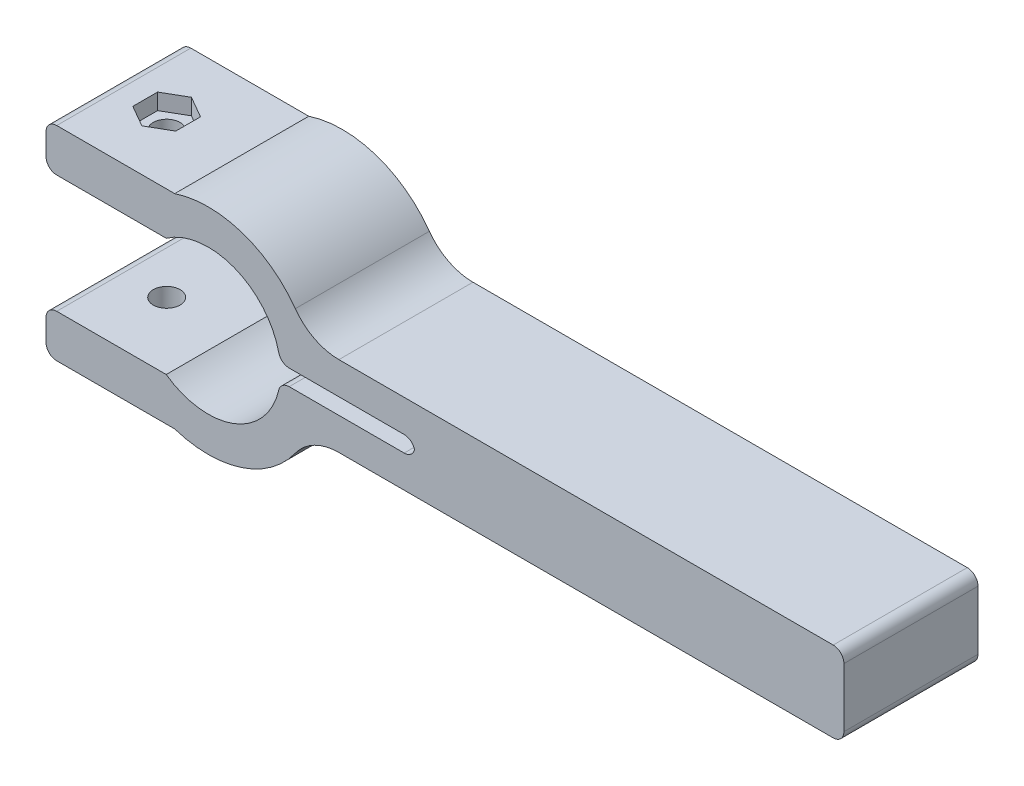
ISO-10303-21;
HEADER;
FILE_DESCRIPTION(('STEP AP214'),'2;1');
FILE_NAME('part.step','',(''),(''),'','','');
FILE_SCHEMA(('AUTOMOTIVE_DESIGN { 1 0 10303 214 1 1 1 1 }'));
ENDSEC;
DATA;
#1=APPLICATION_CONTEXT('core data for automotive mechanical design processes');
#2=APPLICATION_PROTOCOL_DEFINITION('international standard','automotive_design',2000,#1);
#3=PRODUCT_CONTEXT('',#1,'mechanical');
#4=PRODUCT('Part','Part','',(#3));
#5=PRODUCT_RELATED_PRODUCT_CATEGORY('part','',(#4));
#6=PRODUCT_DEFINITION_FORMATION('','',#4);
#7=PRODUCT_DEFINITION_CONTEXT('part definition',#1,'design');
#8=PRODUCT_DEFINITION('design','',#6,#7);
#9=PRODUCT_DEFINITION_SHAPE('','',#8);
#10=(LENGTH_UNIT() NAMED_UNIT(*) SI_UNIT(.MILLI.,.METRE.));
#11=(NAMED_UNIT(*) PLANE_ANGLE_UNIT() SI_UNIT($,.RADIAN.));
#12=(NAMED_UNIT(*) SI_UNIT($,.STERADIAN.) SOLID_ANGLE_UNIT());
#13=UNCERTAINTY_MEASURE_WITH_UNIT(LENGTH_MEASURE(1.E-05),#10,'distance_accuracy_value','');
#14=(GEOMETRIC_REPRESENTATION_CONTEXT(3) GLOBAL_UNCERTAINTY_ASSIGNED_CONTEXT((#13)) GLOBAL_UNIT_ASSIGNED_CONTEXT((#10,
#11,#12)) REPRESENTATION_CONTEXT('',''));
#15=CARTESIAN_POINT('',(0.,0.,0.));
#16=DIRECTION('',(0.,0.,1.));
#17=DIRECTION('',(1.,0.,0.));
#18=AXIS2_PLACEMENT_3D('',#15,#16,#17);
#19=CARTESIAN_POINT('',(0.,0.,25.));
#20=DIRECTION('',(-1.,0.,0.));
#21=DIRECTION('',(0.,-1.,0.));
#22=AXIS2_PLACEMENT_3D('',#19,#20,#21);
#23=PLANE('',#22);
#24=DIRECTION('',(0.,1.,0.));
#25=VECTOR('',#24,1.);
#26=CARTESIAN_POINT('',(0.,0.,0.));
#27=LINE('',#26,#25);
#28=CARTESIAN_POINT('',(0.,2.,0.));
#29=VERTEX_POINT('',#28);
#30=CARTESIAN_POINT('',(0.,13.,0.));
#31=VERTEX_POINT('',#30);
#32=EDGE_CURVE('E305',#29,#31,#27,.T.);
#33=ORIENTED_EDGE('',*,*,#32,.T.);
#34=DIRECTION('',(0.,0.,-1.));
#35=VECTOR('',#34,1.);
#36=CARTESIAN_POINT('',(0.,13.,25.));
#37=LINE('',#36,#35);
#38=CARTESIAN_POINT('',(0.,13.,25.));
#39=VERTEX_POINT('',#38);
#40=EDGE_CURVE('E501',#31,#39,#37,.F.);
#41=ORIENTED_EDGE('',*,*,#40,.T.);
#42=DIRECTION('',(0.,1.,0.));
#43=VECTOR('',#42,1.);
#44=CARTESIAN_POINT('',(0.,0.,25.));
#45=LINE('',#44,#43);
#46=CARTESIAN_POINT('',(0.,2.,25.));
#47=VERTEX_POINT('',#46);
#48=EDGE_CURVE('E313',#47,#39,#45,.T.);
#49=ORIENTED_EDGE('',*,*,#48,.F.);
#50=DIRECTION('',(0.,0.,-1.));
#51=VECTOR('',#50,1.);
#52=CARTESIAN_POINT('',(0.,2.,25.));
#53=LINE('',#52,#51);
#54=EDGE_CURVE('E498',#47,#29,#53,.T.);
#55=ORIENTED_EDGE('',*,*,#54,.T.);
#56=EDGE_LOOP('',(#33,#41,#49,#55));
#57=FACE_BOUND('',#56,.T.);
#58=ADVANCED_FACE('F35',(#57),#23,.F.);
#59=CARTESIAN_POINT('',(0.,15.,25.));
#60=DIRECTION('',(0.,-1.,0.));
#61=DIRECTION('',(1.,0.,0.));
#62=AXIS2_PLACEMENT_3D('',#59,#60,#61);
#63=PLANE('',#62);
#64=DIRECTION('',(-1.,0.,0.));
#65=VECTOR('',#64,1.);
#66=CARTESIAN_POINT('',(0.,15.,25.));
#67=LINE('',#66,#65);
#68=CARTESIAN_POINT('',(-2.,15.,25.));
#69=VERTEX_POINT('',#68);
#70=CARTESIAN_POINT('',(-94.1735103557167,15.,25.));
#71=VERTEX_POINT('',#70);
#72=EDGE_CURVE('E316',#69,#71,#67,.T.);
#73=ORIENTED_EDGE('',*,*,#72,.F.);
#74=DIRECTION('',(0.,0.,-1.));
#75=VECTOR('',#74,1.);
#76=CARTESIAN_POINT('',(-2.,15.,25.));
#77=LINE('',#76,#75);
#78=CARTESIAN_POINT('',(-2.,15.,0.));
#79=VERTEX_POINT('',#78);
#80=EDGE_CURVE('E495',#69,#79,#77,.T.);
#81=ORIENTED_EDGE('',*,*,#80,.T.);
#82=DIRECTION('',(-1.,0.,0.));
#83=VECTOR('',#82,1.);
#84=CARTESIAN_POINT('',(0.,15.,0.));
#85=LINE('',#84,#83);
#86=CARTESIAN_POINT('',(-94.1735103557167,15.,0.));
#87=VERTEX_POINT('',#86);
#88=EDGE_CURVE('E356',#79,#87,#85,.T.);
#89=ORIENTED_EDGE('',*,*,#88,.T.);
#90=DIRECTION('',(0.,0.,1.));
#91=VECTOR('',#90,1.);
#92=CARTESIAN_POINT('',(-94.1735103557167,15.,25.));
#93=LINE('',#92,#91);
#94=EDGE_CURVE('E416',#87,#71,#93,.T.);
#95=ORIENTED_EDGE('',*,*,#94,.T.);
#96=EDGE_LOOP('',(#73,#81,#89,#95));
#97=FACE_BOUND('',#96,.T.);
#98=ADVANCED_FACE('F528',(#97),#63,.F.);
#99=CARTESIAN_POINT('',(-118.540496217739,7.49999999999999,25.));
#100=DIRECTION('',(0.,0.,-1.));
#101=DIRECTION('',(-1.,0.,0.));
#102=AXIS2_PLACEMENT_3D('',#99,#100,#101);
#103=CYLINDRICAL_SURFACE('',#102,20.);
#104=CARTESIAN_POINT('',(-118.540496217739,7.49999999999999,25.));
#105=DIRECTION('',(0.,0.,1.));
#106=DIRECTION('',(1.,0.,0.));
#107=AXIS2_PLACEMENT_3D('',#104,#105,#106);
#108=CIRCLE('',#107,20.);
#109=CARTESIAN_POINT('',(-102.295838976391,19.1666666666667,25.));
#110=VERTEX_POINT('',#109);
#111=CARTESIAN_POINT('',(-124.785494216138,26.5,25.));
#112=VERTEX_POINT('',#111);
#113=EDGE_CURVE('E319',#110,#112,#108,.T.);
#114=ORIENTED_EDGE('',*,*,#113,.F.);
#115=DIRECTION('',(0.,0.,-1.));
#116=VECTOR('',#115,1.);
#117=CARTESIAN_POINT('',(-102.295838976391,19.1666666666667,25.));
#118=LINE('',#117,#116);
#119=CARTESIAN_POINT('',(-102.295838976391,19.1666666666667,0.));
#120=VERTEX_POINT('',#119);
#121=EDGE_CURVE('E413',#110,#120,#118,.T.);
#122=ORIENTED_EDGE('',*,*,#121,.T.);
#123=CARTESIAN_POINT('',(-118.540496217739,7.49999999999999,0.));
#124=DIRECTION('',(0.,0.,1.));
#125=DIRECTION('',(1.,0.,0.));
#126=AXIS2_PLACEMENT_3D('',#123,#124,#125);
#127=CIRCLE('',#126,20.);
#128=CARTESIAN_POINT('',(-124.785494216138,26.5,0.));
#129=VERTEX_POINT('',#128);
#130=EDGE_CURVE('E358',#120,#129,#127,.T.);
#131=ORIENTED_EDGE('',*,*,#130,.T.);
#132=DIRECTION('',(0.,0.,-1.));
#133=VECTOR('',#132,1.);
#134=CARTESIAN_POINT('',(-124.785494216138,26.5,25.));
#135=LINE('',#134,#133);
#136=EDGE_CURVE('E400',#112,#129,#135,.T.);
#137=ORIENTED_EDGE('',*,*,#136,.F.);
#138=EDGE_LOOP('',(#114,#122,#131,#137));
#139=FACE_BOUND('',#138,.T.);
#140=ADVANCED_FACE('F534',(#139),#103,.T.);
#141=CARTESIAN_POINT('',(-124.785494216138,26.5,25.));
#142=DIRECTION('',(0.,-1.,0.));
#143=DIRECTION('',(0.,0.,-1.));
#144=AXIS2_PLACEMENT_3D('',#141,#142,#143);
#145=PLANE('',#144);
#146=DIRECTION('',(-0.866025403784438,0.,0.500000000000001));
#147=VECTOR('',#146,1.);
#148=CARTESIAN_POINT('',(-138.785494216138,26.5,7.88119784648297));
#149=LINE('',#148,#147);
#150=CARTESIAN_POINT('',(-138.785494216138,26.5,7.88119784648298));
#151=VERTEX_POINT('',#150);
#152=CARTESIAN_POINT('',(-142.785494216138,26.5,10.1905989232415));
#153=VERTEX_POINT('',#152);
#154=EDGE_CURVE('E293',#151,#153,#149,.T.);
#155=ORIENTED_EDGE('',*,*,#154,.F.);
#156=DIRECTION('',(-0.866025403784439,0.,-0.499999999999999));
#157=VECTOR('',#156,1.);
#158=CARTESIAN_POINT('',(-134.785494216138,26.5,10.1905989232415));
#159=LINE('',#158,#157);
#160=CARTESIAN_POINT('',(-134.785494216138,26.5,10.1905989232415));
#161=VERTEX_POINT('',#160);
#162=EDGE_CURVE('E258',#161,#151,#159,.T.);
#163=ORIENTED_EDGE('',*,*,#162,.F.);
#164=DIRECTION('',(0.,0.,-1.));
#165=VECTOR('',#164,1.);
#166=CARTESIAN_POINT('',(-134.785494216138,26.5,14.8094010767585));
#167=LINE('',#166,#165);
#168=CARTESIAN_POINT('',(-134.785494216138,26.5,14.8094010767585));
#169=VERTEX_POINT('',#168);
#170=EDGE_CURVE('E276',#169,#161,#167,.T.);
#171=ORIENTED_EDGE('',*,*,#170,.F.);
#172=DIRECTION('',(0.866025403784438,0.,-0.500000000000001));
#173=VECTOR('',#172,1.);
#174=CARTESIAN_POINT('',(-138.785494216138,26.5,17.118802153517));
#175=LINE('',#174,#173);
#176=CARTESIAN_POINT('',(-138.785494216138,26.5,17.118802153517));
#177=VERTEX_POINT('',#176);
#178=EDGE_CURVE('E279',#177,#169,#175,.T.);
#179=ORIENTED_EDGE('',*,*,#178,.F.);
#180=DIRECTION('',(0.866025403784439,0.,0.499999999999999));
#181=VECTOR('',#180,1.);
#182=CARTESIAN_POINT('',(-142.785494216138,26.5,14.8094010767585));
#183=LINE('',#182,#181);
#184=CARTESIAN_POINT('',(-142.785494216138,26.5,14.8094010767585));
#185=VERTEX_POINT('',#184);
#186=EDGE_CURVE('E298',#185,#177,#183,.T.);
#187=ORIENTED_EDGE('',*,*,#186,.F.);
#188=DIRECTION('',(0.,0.,1.));
#189=VECTOR('',#188,1.);
#190=CARTESIAN_POINT('',(-142.785494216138,26.5,10.1905989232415));
#191=LINE('',#190,#189);
#192=EDGE_CURVE('E295',#153,#185,#191,.T.);
#193=ORIENTED_EDGE('',*,*,#192,.F.);
#194=EDGE_LOOP('',(#155,#163,#171,#179,#187,#193));
#195=FACE_BOUND('',#194,.T.);
#196=DIRECTION('',(-1.,0.,0.));
#197=VECTOR('',#196,1.);
#198=CARTESIAN_POINT('',(-124.785494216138,26.5,0.));
#199=LINE('',#198,#197);
#200=CARTESIAN_POINT('',(-146.785494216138,26.5,0.));
#201=VERTEX_POINT('',#200);
#202=EDGE_CURVE('E360',#129,#201,#199,.T.);
#203=ORIENTED_EDGE('',*,*,#202,.T.);
#204=DIRECTION('',(0.,0.,-1.));
#205=VECTOR('',#204,1.);
#206=CARTESIAN_POINT('',(-146.785494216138,26.5,25.));
#207=LINE('',#206,#205);
#208=CARTESIAN_POINT('',(-146.785494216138,26.5,25.));
#209=VERTEX_POINT('',#208);
#210=EDGE_CURVE('E488',#201,#209,#207,.F.);
#211=ORIENTED_EDGE('',*,*,#210,.T.);
#212=DIRECTION('',(-1.,0.,0.));
#213=VECTOR('',#212,1.);
#214=CARTESIAN_POINT('',(-124.785494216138,26.5,25.));
#215=LINE('',#214,#213);
#216=EDGE_CURVE('E321',#112,#209,#215,.T.);
#217=ORIENTED_EDGE('',*,*,#216,.F.);
#218=ORIENTED_EDGE('',*,*,#136,.T.);
#219=EDGE_LOOP('',(#203,#211,#217,#218));
#220=FACE_BOUND('',#219,.T.);
#221=ADVANCED_FACE('F601',(#195,#220),#145,.F.);
#222=CARTESIAN_POINT('',(-148.785494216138,18.5,25.));
#223=DIRECTION('',(1.,0.,0.));
#224=DIRECTION('',(0.,0.,-1.));
#225=AXIS2_PLACEMENT_3D('',#222,#223,#224);
#226=PLANE('',#225);
#227=DIRECTION('',(0.,-1.,0.));
#228=VECTOR('',#227,1.);
#229=CARTESIAN_POINT('',(-148.785494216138,18.5,25.));
#230=LINE('',#229,#228);
#231=CARTESIAN_POINT('',(-148.785494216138,24.5,25.));
#232=VERTEX_POINT('',#231);
#233=CARTESIAN_POINT('',(-148.785494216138,20.5,25.));
#234=VERTEX_POINT('',#233);
#235=EDGE_CURVE('E324',#232,#234,#230,.T.);
#236=ORIENTED_EDGE('',*,*,#235,.F.);
#237=DIRECTION('',(0.,0.,-1.));
#238=VECTOR('',#237,1.);
#239=CARTESIAN_POINT('',(-148.785494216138,24.5,25.));
#240=LINE('',#239,#238);
#241=CARTESIAN_POINT('',(-148.785494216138,24.5,0.));
#242=VERTEX_POINT('',#241);
#243=EDGE_CURVE('E485',#232,#242,#240,.T.);
#244=ORIENTED_EDGE('',*,*,#243,.T.);
#245=DIRECTION('',(0.,-1.,0.));
#246=VECTOR('',#245,1.);
#247=CARTESIAN_POINT('',(-148.785494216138,18.5,0.));
#248=LINE('',#247,#246);
#249=CARTESIAN_POINT('',(-148.785494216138,20.5,0.));
#250=VERTEX_POINT('',#249);
#251=EDGE_CURVE('E363',#242,#250,#248,.T.);
#252=ORIENTED_EDGE('',*,*,#251,.T.);
#253=DIRECTION('',(0.,0.,-1.));
#254=VECTOR('',#253,1.);
#255=CARTESIAN_POINT('',(-148.785494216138,20.5,25.));
#256=LINE('',#255,#254);
#257=EDGE_CURVE('E483',#250,#234,#256,.F.);
#258=ORIENTED_EDGE('',*,*,#257,.T.);
#259=EDGE_LOOP('',(#236,#244,#252,#258));
#260=FACE_BOUND('',#259,.T.);
#261=ADVANCED_FACE('F608',(#260),#226,.F.);
#262=CARTESIAN_POINT('',(-148.785494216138,18.5,25.));
#263=DIRECTION('',(0.,1.,0.));
#264=DIRECTION('',(-1.,0.,0.));
#265=AXIS2_PLACEMENT_3D('',#262,#263,#264);
#266=PLANE('',#265);
#267=CARTESIAN_POINT('',(-138.785494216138,18.5,12.5));
#268=DIRECTION('',(0.,1.,0.));
#269=DIRECTION('',(-1.,0.,0.));
#270=AXIS2_PLACEMENT_3D('',#267,#268,#269);
#271=CIRCLE('',#270,2.5);
#272=CARTESIAN_POINT('',(-141.285494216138,18.5,12.5));
#273=VERTEX_POINT('',#272);
#274=EDGE_CURVE('E282',#273,#273,#271,.T.);
#275=ORIENTED_EDGE('',*,*,#274,.T.);
#276=EDGE_LOOP('',(#275));
#277=FACE_BOUND('',#276,.T.);
#278=DIRECTION('',(1.,0.,0.));
#279=VECTOR('',#278,1.);
#280=CARTESIAN_POINT('',(-148.785494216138,18.5,25.));
#281=LINE('',#280,#279);
#282=CARTESIAN_POINT('',(-146.785494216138,18.5,25.));
#283=VERTEX_POINT('',#282);
#284=CARTESIAN_POINT('',(-126.366734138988,18.5,25.));
#285=VERTEX_POINT('',#284);
#286=EDGE_CURVE('E327',#283,#285,#281,.T.);
#287=ORIENTED_EDGE('',*,*,#286,.F.);
#288=DIRECTION('',(0.,0.,-1.));
#289=VECTOR('',#288,1.);
#290=CARTESIAN_POINT('',(-146.785494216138,18.5,25.));
#291=LINE('',#290,#289);
#292=CARTESIAN_POINT('',(-146.785494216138,18.5,0.));
#293=VERTEX_POINT('',#292);
#294=EDGE_CURVE('E490',#283,#293,#291,.T.);
#295=ORIENTED_EDGE('',*,*,#294,.T.);
#296=DIRECTION('',(1.,0.,0.));
#297=VECTOR('',#296,1.);
#298=CARTESIAN_POINT('',(-148.785494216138,18.5,0.));
#299=LINE('',#298,#297);
#300=CARTESIAN_POINT('',(-126.366734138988,18.5,0.));
#301=VERTEX_POINT('',#300);
#302=EDGE_CURVE('E366',#293,#301,#299,.T.);
#303=ORIENTED_EDGE('',*,*,#302,.T.);
#304=DIRECTION('',(0.,0.,-1.));
#305=VECTOR('',#304,1.);
#306=CARTESIAN_POINT('',(-126.366734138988,18.5,25.));
#307=LINE('',#306,#305);
#308=EDGE_CURVE('E397',#285,#301,#307,.T.);
#309=ORIENTED_EDGE('',*,*,#308,.F.);
#310=EDGE_LOOP('',(#287,#295,#303,#309));
#311=FACE_BOUND('',#310,.T.);
#312=ADVANCED_FACE('F618',(#277,#311),#266,.F.);
#313=CARTESIAN_POINT('',(-118.540496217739,7.49999999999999,25.));
#314=DIRECTION('',(0.,0.,-1.));
#315=DIRECTION('',(-1.,0.,0.));
#316=AXIS2_PLACEMENT_3D('',#313,#314,#315);
#317=CYLINDRICAL_SURFACE('',#316,13.5);
#318=CARTESIAN_POINT('',(-118.540496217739,7.49999999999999,0.));
#319=DIRECTION('',(0.,0.,-1.));
#320=DIRECTION('',(1.,0.,0.));
#321=AXIS2_PLACEMENT_3D('',#318,#319,#320);
#322=CIRCLE('',#321,13.5);
#323=CARTESIAN_POINT('',(-105.38917171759,10.5483870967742,0.));
#324=VERTEX_POINT('',#323);
#325=EDGE_CURVE('E368',#301,#324,#322,.T.);
#326=ORIENTED_EDGE('',*,*,#325,.T.);
#327=DIRECTION('',(0.,0.,-1.));
#328=VECTOR('',#327,1.);
#329=CARTESIAN_POINT('',(-105.38917171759,10.5483870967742,25.));
#330=LINE('',#329,#328);
#331=CARTESIAN_POINT('',(-105.38917171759,10.5483870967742,25.));
#332=VERTEX_POINT('',#331);
#333=EDGE_CURVE('E473',#324,#332,#330,.F.);
#334=ORIENTED_EDGE('',*,*,#333,.T.);
#335=CARTESIAN_POINT('',(-118.540496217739,7.49999999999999,25.));
#336=DIRECTION('',(0.,0.,-1.));
#337=DIRECTION('',(1.,0.,0.));
#338=AXIS2_PLACEMENT_3D('',#335,#336,#337);
#339=CIRCLE('',#338,13.5);
#340=EDGE_CURVE('E329',#285,#332,#339,.T.);
#341=ORIENTED_EDGE('',*,*,#340,.F.);
#342=ORIENTED_EDGE('',*,*,#308,.T.);
#343=EDGE_LOOP('',(#326,#334,#341,#342));
#344=FACE_BOUND('',#343,.T.);
#345=ADVANCED_FACE('F695',(#344),#317,.F.);
#346=CARTESIAN_POINT('',(-105.12408835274,8.99999999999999,25.));
#347=DIRECTION('',(0.,1.,0.));
#348=DIRECTION('',(0.,0.,1.));
#349=AXIS2_PLACEMENT_3D('',#346,#347,#348);
#350=PLANE('',#349);
#351=DIRECTION('',(1.,0.,0.));
#352=VECTOR('',#351,1.);
#353=CARTESIAN_POINT('',(-105.12408835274,8.99999999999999,0.));
#354=LINE('',#353,#352);
#355=CARTESIAN_POINT('',(-103.440827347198,8.99999999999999,0.));
#356=VERTEX_POINT('',#355);
#357=CARTESIAN_POINT('',(-82.,8.99999999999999,0.));
#358=VERTEX_POINT('',#357);
#359=EDGE_CURVE('E371',#356,#358,#354,.T.);
#360=ORIENTED_EDGE('',*,*,#359,.T.);
#361=DIRECTION('',(0.,0.,-1.));
#362=VECTOR('',#361,1.);
#363=CARTESIAN_POINT('',(-82.,8.99999999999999,25.));
#364=LINE('',#363,#362);
#365=CARTESIAN_POINT('',(-82.,8.99999999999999,25.));
#366=VERTEX_POINT('',#365);
#367=EDGE_CURVE('E436',#358,#366,#364,.F.);
#368=ORIENTED_EDGE('',*,*,#367,.T.);
#369=DIRECTION('',(1.,0.,0.));
#370=VECTOR('',#369,1.);
#371=CARTESIAN_POINT('',(-105.12408835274,8.99999999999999,25.));
#372=LINE('',#371,#370);
#373=CARTESIAN_POINT('',(-103.440827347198,8.99999999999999,25.));
#374=VERTEX_POINT('',#373);
#375=EDGE_CURVE('E332',#374,#366,#372,.T.);
#376=ORIENTED_EDGE('',*,*,#375,.F.);
#377=DIRECTION('',(0.,0.,-1.));
#378=VECTOR('',#377,1.);
#379=CARTESIAN_POINT('',(-103.440827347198,8.99999999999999,25.));
#380=LINE('',#379,#378);
#381=EDGE_CURVE('E433',#374,#356,#380,.T.);
#382=ORIENTED_EDGE('',*,*,#381,.T.);
#383=EDGE_LOOP('',(#360,#368,#376,#382));
#384=FACE_BOUND('',#383,.T.);
#385=ADVANCED_FACE('F628',(#384),#350,.F.);
#386=CARTESIAN_POINT('',(-105.12408835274,5.99999999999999,25.));
#387=DIRECTION('',(0.,-1.,0.));
#388=DIRECTION('',(1.,0.,0.));
#389=AXIS2_PLACEMENT_3D('',#386,#387,#388);
#390=PLANE('',#389);
#391=DIRECTION('',(-1.,0.,0.));
#392=VECTOR('',#391,1.);
#393=CARTESIAN_POINT('',(-105.12408835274,5.99999999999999,25.));
#394=LINE('',#393,#392);
#395=CARTESIAN_POINT('',(-82.,5.99999999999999,25.));
#396=VERTEX_POINT('',#395);
#397=CARTESIAN_POINT('',(-103.440827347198,5.99999999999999,25.));
#398=VERTEX_POINT('',#397);
#399=EDGE_CURVE('E334',#396,#398,#394,.T.);
#400=ORIENTED_EDGE('',*,*,#399,.F.);
#401=DIRECTION('',(0.,0.,-1.));
#402=VECTOR('',#401,1.);
#403=CARTESIAN_POINT('',(-82.,5.99999999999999,0.));
#404=LINE('',#403,#402);
#405=CARTESIAN_POINT('',(-82.,5.99999999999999,0.));
#406=VERTEX_POINT('',#405);
#407=EDGE_CURVE('E430',#396,#406,#404,.T.);
#408=ORIENTED_EDGE('',*,*,#407,.T.);
#409=DIRECTION('',(-1.,0.,0.));
#410=VECTOR('',#409,1.);
#411=CARTESIAN_POINT('',(-105.12408835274,5.99999999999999,0.));
#412=LINE('',#411,#410);
#413=CARTESIAN_POINT('',(-103.440827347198,5.99999999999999,0.));
#414=VERTEX_POINT('',#413);
#415=EDGE_CURVE('E374',#406,#414,#412,.T.);
#416=ORIENTED_EDGE('',*,*,#415,.T.);
#417=DIRECTION('',(0.,0.,-1.));
#418=VECTOR('',#417,1.);
#419=CARTESIAN_POINT('',(-103.440827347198,5.99999999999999,25.));
#420=LINE('',#419,#418);
#421=EDGE_CURVE('E428',#414,#398,#420,.F.);
#422=ORIENTED_EDGE('',*,*,#421,.T.);
#423=EDGE_LOOP('',(#400,#408,#416,#422));
#424=FACE_BOUND('',#423,.T.);
#425=ADVANCED_FACE('F635',(#424),#390,.F.);
#426=CARTESIAN_POINT('',(-118.540496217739,7.49999999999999,25.));
#427=DIRECTION('',(0.,0.,-1.));
#428=DIRECTION('',(-1.,0.,0.));
#429=AXIS2_PLACEMENT_3D('',#426,#427,#428);
#430=CYLINDRICAL_SURFACE('',#429,13.5);
#431=CARTESIAN_POINT('',(-118.540496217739,7.49999999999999,25.));
#432=DIRECTION('',(0.,0.,-1.));
#433=DIRECTION('',(1.,0.,0.));
#434=AXIS2_PLACEMENT_3D('',#431,#432,#433);
#435=CIRCLE('',#434,13.5);
#436=CARTESIAN_POINT('',(-105.38917171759,4.45161290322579,25.));
#437=VERTEX_POINT('',#436);
#438=CARTESIAN_POINT('',(-126.366734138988,-3.50000000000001,25.));
#439=VERTEX_POINT('',#438);
#440=EDGE_CURVE('E337',#437,#439,#435,.T.);
#441=ORIENTED_EDGE('',*,*,#440,.F.);
#442=DIRECTION('',(0.,0.,-1.));
#443=VECTOR('',#442,1.);
#444=CARTESIAN_POINT('',(-105.38917171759,4.45161290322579,25.));
#445=LINE('',#444,#443);
#446=CARTESIAN_POINT('',(-105.38917171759,4.45161290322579,0.));
#447=VERTEX_POINT('',#446);
#448=EDGE_CURVE('E438',#437,#447,#445,.T.);
#449=ORIENTED_EDGE('',*,*,#448,.T.);
#450=CARTESIAN_POINT('',(-118.540496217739,7.49999999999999,0.));
#451=DIRECTION('',(0.,0.,-1.));
#452=DIRECTION('',(1.,0.,0.));
#453=AXIS2_PLACEMENT_3D('',#450,#451,#452);
#454=CIRCLE('',#453,13.5);
#455=CARTESIAN_POINT('',(-126.366734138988,-3.50000000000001,0.));
#456=VERTEX_POINT('',#455);
#457=EDGE_CURVE('E377',#447,#456,#454,.T.);
#458=ORIENTED_EDGE('',*,*,#457,.T.);
#459=DIRECTION('',(0.,0.,-1.));
#460=VECTOR('',#459,1.);
#461=CARTESIAN_POINT('',(-126.366734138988,-3.50000000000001,25.));
#462=LINE('',#461,#460);
#463=EDGE_CURVE('E394',#439,#456,#462,.T.);
#464=ORIENTED_EDGE('',*,*,#463,.F.);
#465=EDGE_LOOP('',(#441,#449,#458,#464));
#466=FACE_BOUND('',#465,.T.);
#467=ADVANCED_FACE('F641',(#466),#430,.F.);
#468=CARTESIAN_POINT('',(-148.785494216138,-3.50000000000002,25.));
#469=DIRECTION('',(0.,-1.,0.));
#470=DIRECTION('',(1.,0.,0.));
#471=AXIS2_PLACEMENT_3D('',#468,#469,#470);
#472=PLANE('',#471);
#473=CARTESIAN_POINT('',(-138.785494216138,-3.50000000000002,12.5));
#474=DIRECTION('',(0.,-1.,0.));
#475=DIRECTION('',(1.,0.,0.));
#476=AXIS2_PLACEMENT_3D('',#473,#474,#475);
#477=CIRCLE('',#476,2.5);
#478=CARTESIAN_POINT('',(-136.285494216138,-3.50000000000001,12.5));
#479=VERTEX_POINT('',#478);
#480=EDGE_CURVE('E407',#479,#479,#477,.T.);
#481=ORIENTED_EDGE('',*,*,#480,.T.);
#482=EDGE_LOOP('',(#481));
#483=FACE_BOUND('',#482,.T.);
#484=DIRECTION('',(-1.,0.,0.));
#485=VECTOR('',#484,1.);
#486=CARTESIAN_POINT('',(-148.785494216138,-3.50000000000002,0.));
#487=LINE('',#486,#485);
#488=CARTESIAN_POINT('',(-146.785494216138,-3.50000000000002,0.));
#489=VERTEX_POINT('',#488);
#490=EDGE_CURVE('E379',#456,#489,#487,.T.);
#491=ORIENTED_EDGE('',*,*,#490,.T.);
#492=DIRECTION('',(0.,0.,-1.));
#493=VECTOR('',#492,1.);
#494=CARTESIAN_POINT('',(-146.785494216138,-3.50000000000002,25.));
#495=LINE('',#494,#493);
#496=CARTESIAN_POINT('',(-146.785494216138,-3.50000000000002,25.));
#497=VERTEX_POINT('',#496);
#498=EDGE_CURVE('E493',#489,#497,#495,.F.);
#499=ORIENTED_EDGE('',*,*,#498,.T.);
#500=DIRECTION('',(-1.,0.,0.));
#501=VECTOR('',#500,1.);
#502=CARTESIAN_POINT('',(-148.785494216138,-3.50000000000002,25.));
#503=LINE('',#502,#501);
#504=EDGE_CURVE('E339',#439,#497,#503,.T.);
#505=ORIENTED_EDGE('',*,*,#504,.F.);
#506=ORIENTED_EDGE('',*,*,#463,.T.);
#507=EDGE_LOOP('',(#491,#499,#505,#506));
#508=FACE_BOUND('',#507,.T.);
#509=ADVANCED_FACE('F645',(#483,#508),#472,.F.);
#510=CARTESIAN_POINT('',(-148.785494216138,-11.5,25.));
#511=DIRECTION('',(1.,0.,0.));
#512=DIRECTION('',(0.,0.,-1.));
#513=AXIS2_PLACEMENT_3D('',#510,#511,#512);
#514=PLANE('',#513);
#515=DIRECTION('',(0.,-1.,0.));
#516=VECTOR('',#515,1.);
#517=CARTESIAN_POINT('',(-148.785494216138,-11.5,0.));
#518=LINE('',#517,#516);
#519=CARTESIAN_POINT('',(-148.785494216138,-5.50000000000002,0.));
#520=VERTEX_POINT('',#519);
#521=CARTESIAN_POINT('',(-148.785494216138,-9.50000000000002,0.));
#522=VERTEX_POINT('',#521);
#523=EDGE_CURVE('E382',#520,#522,#518,.T.);
#524=ORIENTED_EDGE('',*,*,#523,.T.);
#525=DIRECTION('',(0.,0.,-1.));
#526=VECTOR('',#525,1.);
#527=CARTESIAN_POINT('',(-148.785494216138,-9.50000000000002,25.));
#528=LINE('',#527,#526);
#529=CARTESIAN_POINT('',(-148.785494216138,-9.50000000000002,25.));
#530=VERTEX_POINT('',#529);
#531=EDGE_CURVE('E481',#522,#530,#528,.F.);
#532=ORIENTED_EDGE('',*,*,#531,.T.);
#533=DIRECTION('',(0.,-1.,0.));
#534=VECTOR('',#533,1.);
#535=CARTESIAN_POINT('',(-148.785494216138,-11.5,25.));
#536=LINE('',#535,#534);
#537=CARTESIAN_POINT('',(-148.785494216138,-5.50000000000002,25.));
#538=VERTEX_POINT('',#537);
#539=EDGE_CURVE('E342',#538,#530,#536,.T.);
#540=ORIENTED_EDGE('',*,*,#539,.F.);
#541=DIRECTION('',(0.,0.,-1.));
#542=VECTOR('',#541,1.);
#543=CARTESIAN_POINT('',(-148.785494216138,-5.50000000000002,25.));
#544=LINE('',#543,#542);
#545=EDGE_CURVE('E478',#538,#520,#544,.T.);
#546=ORIENTED_EDGE('',*,*,#545,.T.);
#547=EDGE_LOOP('',(#524,#532,#540,#546));
#548=FACE_BOUND('',#547,.T.);
#549=ADVANCED_FACE('F652',(#548),#514,.F.);
#550=CARTESIAN_POINT('',(-124.785494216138,-11.5,25.));
#551=DIRECTION('',(0.,1.,0.));
#552=DIRECTION('',(-1.,0.,0.));
#553=AXIS2_PLACEMENT_3D('',#550,#551,#552);
#554=PLANE('',#553);
#555=CARTESIAN_POINT('',(-138.785494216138,-11.5,12.5));
#556=DIRECTION('',(0.,1.,0.));
#557=DIRECTION('',(-1.,0.,0.));
#558=AXIS2_PLACEMENT_3D('',#555,#556,#557);
#559=CIRCLE('',#558,4.5);
#560=CARTESIAN_POINT('',(-143.285494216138,-11.5,12.5));
#561=VERTEX_POINT('',#560);
#562=EDGE_CURVE('E43',#561,#561,#559,.T.);
#563=ORIENTED_EDGE('',*,*,#562,.T.);
#564=EDGE_LOOP('',(#563));
#565=FACE_BOUND('',#564,.T.);
#566=DIRECTION('',(1.,0.,0.));
#567=VECTOR('',#566,1.);
#568=CARTESIAN_POINT('',(-124.785494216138,-11.5,25.));
#569=LINE('',#568,#567);
#570=CARTESIAN_POINT('',(-146.785494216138,-11.5,25.));
#571=VERTEX_POINT('',#570);
#572=CARTESIAN_POINT('',(-124.785494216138,-11.5,25.));
#573=VERTEX_POINT('',#572);
#574=EDGE_CURVE('E345',#571,#573,#569,.T.);
#575=ORIENTED_EDGE('',*,*,#574,.F.);
#576=DIRECTION('',(0.,0.,-1.));
#577=VECTOR('',#576,1.);
#578=CARTESIAN_POINT('',(-146.785494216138,-11.5,25.));
#579=LINE('',#578,#577);
#580=CARTESIAN_POINT('',(-146.785494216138,-11.5,0.));
#581=VERTEX_POINT('',#580);
#582=EDGE_CURVE('E475',#571,#581,#579,.T.);
#583=ORIENTED_EDGE('',*,*,#582,.T.);
#584=DIRECTION('',(1.,0.,0.));
#585=VECTOR('',#584,1.);
#586=CARTESIAN_POINT('',(-124.785494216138,-11.5,0.));
#587=LINE('',#586,#585);
#588=CARTESIAN_POINT('',(-124.785494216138,-11.5,0.));
#589=VERTEX_POINT('',#588);
#590=EDGE_CURVE('E385',#581,#589,#587,.T.);
#591=ORIENTED_EDGE('',*,*,#590,.T.);
#592=DIRECTION('',(0.,0.,-1.));
#593=VECTOR('',#592,1.);
#594=CARTESIAN_POINT('',(-124.785494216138,-11.5,25.));
#595=LINE('',#594,#593);
#596=EDGE_CURVE('E353',#573,#589,#595,.T.);
#597=ORIENTED_EDGE('',*,*,#596,.F.);
#598=EDGE_LOOP('',(#575,#583,#591,#597));
#599=FACE_BOUND('',#598,.T.);
#600=ADVANCED_FACE('F515',(#565,#599),#554,.F.);
#601=CARTESIAN_POINT('',(-118.540496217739,7.49999999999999,25.));
#602=DIRECTION('',(0.,0.,-1.));
#603=DIRECTION('',(-1.,0.,0.));
#604=AXIS2_PLACEMENT_3D('',#601,#602,#603);
#605=CYLINDRICAL_SURFACE('',#604,20.);
#606=CARTESIAN_POINT('',(-118.540496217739,7.49999999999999,0.));
#607=DIRECTION('',(0.,0.,1.));
#608=DIRECTION('',(1.,0.,0.));
#609=AXIS2_PLACEMENT_3D('',#606,#607,#608);
#610=CIRCLE('',#609,20.);
#611=CARTESIAN_POINT('',(-102.295838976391,-4.16666666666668,0.));
#612=VERTEX_POINT('',#611);
#613=EDGE_CURVE('E387',#589,#612,#610,.T.);
#614=ORIENTED_EDGE('',*,*,#613,.T.);
#615=DIRECTION('',(0.,0.,-1.));
#616=VECTOR('',#615,1.);
#617=CARTESIAN_POINT('',(-102.295838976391,-4.16666666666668,25.));
#618=LINE('',#617,#616);
#619=CARTESIAN_POINT('',(-102.295838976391,-4.16666666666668,25.));
#620=VERTEX_POINT('',#619);
#621=EDGE_CURVE('E411',#612,#620,#618,.F.);
#622=ORIENTED_EDGE('',*,*,#621,.T.);
#623=CARTESIAN_POINT('',(-118.540496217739,7.49999999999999,25.));
#624=DIRECTION('',(0.,0.,1.));
#625=DIRECTION('',(1.,0.,0.));
#626=AXIS2_PLACEMENT_3D('',#623,#624,#625);
#627=CIRCLE('',#626,20.);
#628=EDGE_CURVE('E347',#573,#620,#627,.T.);
#629=ORIENTED_EDGE('',*,*,#628,.F.);
#630=ORIENTED_EDGE('',*,*,#596,.T.);
#631=EDGE_LOOP('',(#614,#622,#629,#630));
#632=FACE_BOUND('',#631,.T.);
#633=ADVANCED_FACE('F673',(#632),#605,.T.);
#634=CARTESIAN_POINT('',(0.,0.,25.));
#635=DIRECTION('',(0.,1.,0.));
#636=DIRECTION('',(-1.,0.,0.));
#637=AXIS2_PLACEMENT_3D('',#634,#635,#636);
#638=PLANE('',#637);
#639=DIRECTION('',(1.,0.,0.));
#640=VECTOR('',#639,1.);
#641=CARTESIAN_POINT('',(0.,0.,0.));
#642=LINE('',#641,#640);
#643=CARTESIAN_POINT('',(-94.1735103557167,0.,0.));
#644=VERTEX_POINT('',#643);
#645=CARTESIAN_POINT('',(-2.,0.,0.));
#646=VERTEX_POINT('',#645);
#647=EDGE_CURVE('E317',#644,#646,#642,.T.);
#648=ORIENTED_EDGE('',*,*,#647,.T.);
#649=DIRECTION('',(0.,0.,-1.));
#650=VECTOR('',#649,1.);
#651=CARTESIAN_POINT('',(-2.,0.,25.));
#652=LINE('',#651,#650);
#653=CARTESIAN_POINT('',(-2.,0.,25.));
#654=VERTEX_POINT('',#653);
#655=EDGE_CURVE('E503',#646,#654,#652,.F.);
#656=ORIENTED_EDGE('',*,*,#655,.T.);
#657=DIRECTION('',(1.,0.,0.));
#658=VECTOR('',#657,1.);
#659=CARTESIAN_POINT('',(0.,0.,25.));
#660=LINE('',#659,#658);
#661=CARTESIAN_POINT('',(-94.1735103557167,0.,25.));
#662=VERTEX_POINT('',#661);
#663=EDGE_CURVE('E350',#662,#654,#660,.T.);
#664=ORIENTED_EDGE('',*,*,#663,.F.);
#665=DIRECTION('',(0.,0.,1.));
#666=VECTOR('',#665,1.);
#667=CARTESIAN_POINT('',(-94.1735103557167,0.,0.));
#668=LINE('',#667,#666);
#669=EDGE_CURVE('E403',#662,#644,#668,.F.);
#670=ORIENTED_EDGE('',*,*,#669,.T.);
#671=EDGE_LOOP('',(#648,#656,#664,#670));
#672=FACE_BOUND('',#671,.T.);
#673=ADVANCED_FACE('F668',(#672),#638,.F.);
#674=CARTESIAN_POINT('',(-118.540496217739,7.49999999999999,25.));
#675=DIRECTION('',(0.,0.,1.));
#676=DIRECTION('',(1.,0.,0.));
#677=AXIS2_PLACEMENT_3D('',#674,#675,#676);
#678=PLANE('',#677);
#679=ORIENTED_EDGE('',*,*,#399,.T.);
#680=CARTESIAN_POINT('',(-103.440827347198,3.99999999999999,25.));
#681=DIRECTION('',(0.,0.,1.));
#682=DIRECTION('',(1.,0.,0.));
#683=AXIS2_PLACEMENT_3D('',#680,#681,#682);
#684=CIRCLE('',#683,2.);
#685=EDGE_CURVE('E471',#398,#437,#684,.T.);
#686=ORIENTED_EDGE('',*,*,#685,.T.);
#687=ORIENTED_EDGE('',*,*,#440,.T.);
#688=ORIENTED_EDGE('',*,*,#504,.T.);
#689=CARTESIAN_POINT('',(-146.785494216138,-5.50000000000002,25.));
#690=DIRECTION('',(0.,0.,1.));
#691=DIRECTION('',(1.,0.,0.));
#692=AXIS2_PLACEMENT_3D('',#689,#690,#691);
#693=CIRCLE('',#692,2.);
#694=EDGE_CURVE('E461',#497,#538,#693,.T.);
#695=ORIENTED_EDGE('',*,*,#694,.T.);
#696=ORIENTED_EDGE('',*,*,#539,.T.);
#697=CARTESIAN_POINT('',(-146.785494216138,-9.50000000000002,25.));
#698=DIRECTION('',(0.,0.,1.));
#699=DIRECTION('',(1.,0.,0.));
#700=AXIS2_PLACEMENT_3D('',#697,#698,#699);
#701=CIRCLE('',#700,2.);
#702=EDGE_CURVE('E467',#530,#571,#701,.T.);
#703=ORIENTED_EDGE('',*,*,#702,.T.);
#704=ORIENTED_EDGE('',*,*,#574,.T.);
#705=ORIENTED_EDGE('',*,*,#628,.T.);
#706=CARTESIAN_POINT('',(-94.1735103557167,-10.,25.));
#707=DIRECTION('',(0.,0.,1.));
#708=DIRECTION('',(1.,0.,0.));
#709=AXIS2_PLACEMENT_3D('',#706,#707,#708);
#710=CIRCLE('',#709,10.);
#711=EDGE_CURVE('E421',#620,#662,#710,.F.);
#712=ORIENTED_EDGE('',*,*,#711,.T.);
#713=ORIENTED_EDGE('',*,*,#663,.T.);
#714=CARTESIAN_POINT('',(-2.,2.,25.));
#715=DIRECTION('',(0.,0.,1.));
#716=DIRECTION('',(1.,0.,0.));
#717=AXIS2_PLACEMENT_3D('',#714,#715,#716);
#718=CIRCLE('',#717,2.);
#719=EDGE_CURVE('E457',#654,#47,#718,.T.);
#720=ORIENTED_EDGE('',*,*,#719,.T.);
#721=ORIENTED_EDGE('',*,*,#48,.T.);
#722=CARTESIAN_POINT('',(-2.,13.,25.));
#723=DIRECTION('',(0.,0.,1.));
#724=DIRECTION('',(1.,0.,0.));
#725=AXIS2_PLACEMENT_3D('',#722,#723,#724);
#726=CIRCLE('',#725,2.);
#727=EDGE_CURVE('E459',#39,#69,#726,.T.);
#728=ORIENTED_EDGE('',*,*,#727,.T.);
#729=ORIENTED_EDGE('',*,*,#72,.T.);
#730=CARTESIAN_POINT('',(-94.1735103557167,25.,25.));
#731=DIRECTION('',(0.,0.,1.));
#732=DIRECTION('',(1.,0.,0.));
#733=AXIS2_PLACEMENT_3D('',#730,#731,#732);
#734=CIRCLE('',#733,10.);
#735=EDGE_CURVE('E426',#71,#110,#734,.F.);
#736=ORIENTED_EDGE('',*,*,#735,.T.);
#737=ORIENTED_EDGE('',*,*,#113,.T.);
#738=ORIENTED_EDGE('',*,*,#216,.T.);
#739=CARTESIAN_POINT('',(-146.785494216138,24.5,25.));
#740=DIRECTION('',(0.,0.,1.));
#741=DIRECTION('',(1.,0.,0.));
#742=AXIS2_PLACEMENT_3D('',#739,#740,#741);
#743=CIRCLE('',#742,2.);
#744=EDGE_CURVE('E465',#209,#232,#743,.T.);
#745=ORIENTED_EDGE('',*,*,#744,.T.);
#746=ORIENTED_EDGE('',*,*,#235,.T.);
#747=CARTESIAN_POINT('',(-146.785494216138,20.5,25.));
#748=DIRECTION('',(0.,0.,1.));
#749=DIRECTION('',(1.,0.,0.));
#750=AXIS2_PLACEMENT_3D('',#747,#748,#749);
#751=CIRCLE('',#750,2.);
#752=EDGE_CURVE('E463',#234,#283,#751,.T.);
#753=ORIENTED_EDGE('',*,*,#752,.T.);
#754=ORIENTED_EDGE('',*,*,#286,.T.);
#755=ORIENTED_EDGE('',*,*,#340,.T.);
#756=CARTESIAN_POINT('',(-103.440827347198,11.,25.));
#757=DIRECTION('',(0.,0.,1.));
#758=DIRECTION('',(1.,0.,0.));
#759=AXIS2_PLACEMENT_3D('',#756,#757,#758);
#760=CIRCLE('',#759,2.);
#761=EDGE_CURVE('E469',#332,#374,#760,.T.);
#762=ORIENTED_EDGE('',*,*,#761,.T.);
#763=ORIENTED_EDGE('',*,*,#375,.T.);
#764=CARTESIAN_POINT('',(-82.,6.99999999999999,25.));
#765=DIRECTION('',(0.,0.,1.));
#766=DIRECTION('',(1.,0.,0.));
#767=AXIS2_PLACEMENT_3D('',#764,#765,#766);
#768=CIRCLE('',#767,2.);
#769=CARTESIAN_POINT('',(-80.0635083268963,7.49999999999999,25.));
#770=VERTEX_POINT('',#769);
#771=EDGE_CURVE('E50',#366,#770,#768,.F.);
#772=ORIENTED_EDGE('',*,*,#771,.T.);
#773=CARTESIAN_POINT('',(-82.,7.99999999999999,25.));
#774=DIRECTION('',(0.,0.,1.));
#775=DIRECTION('',(1.,0.,0.));
#776=AXIS2_PLACEMENT_3D('',#773,#774,#775);
#777=CIRCLE('',#776,2.);
#778=EDGE_CURVE('E506',#770,#396,#777,.F.);
#779=ORIENTED_EDGE('',*,*,#778,.T.);
#780=EDGE_LOOP('',(#679,#686,#687,#688,#695,#696,#703,#704,#705,#712,#713,#720,#721,#728,#729,
#736,#737,#738,#745,#746,#753,#754,#755,#762,#763,#772,#779));
#781=FACE_BOUND('',#780,.T.);
#782=ADVANCED_FACE('F588',(#781),#678,.T.);
#783=CARTESIAN_POINT('',(-118.540496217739,7.49999999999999,0.));
#784=DIRECTION('',(0.,0.,1.));
#785=DIRECTION('',(1.,0.,0.));
#786=AXIS2_PLACEMENT_3D('',#783,#784,#785);
#787=PLANE('',#786);
#788=ORIENTED_EDGE('',*,*,#457,.F.);
#789=CARTESIAN_POINT('',(-103.440827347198,3.99999999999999,0.));
#790=DIRECTION('',(0.,0.,1.));
#791=DIRECTION('',(1.,0.,0.));
#792=AXIS2_PLACEMENT_3D('',#789,#790,#791);
#793=CIRCLE('',#792,2.);
#794=EDGE_CURVE('E455',#447,#414,#793,.F.);
#795=ORIENTED_EDGE('',*,*,#794,.T.);
#796=ORIENTED_EDGE('',*,*,#415,.F.);
#797=CARTESIAN_POINT('',(-82.,7.99999999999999,0.));
#798=DIRECTION('',(0.,0.,1.));
#799=DIRECTION('',(1.,0.,0.));
#800=AXIS2_PLACEMENT_3D('',#797,#798,#799);
#801=CIRCLE('',#800,2.);
#802=CARTESIAN_POINT('',(-80.0635083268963,7.49999999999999,0.));
#803=VERTEX_POINT('',#802);
#804=EDGE_CURVE('E58',#406,#803,#801,.T.);
#805=ORIENTED_EDGE('',*,*,#804,.T.);
#806=CARTESIAN_POINT('',(-82.,6.99999999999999,0.));
#807=DIRECTION('',(0.,0.,1.));
#808=DIRECTION('',(1.,0.,0.));
#809=AXIS2_PLACEMENT_3D('',#806,#807,#808);
#810=CIRCLE('',#809,2.);
#811=EDGE_CURVE('E508',#803,#358,#810,.T.);
#812=ORIENTED_EDGE('',*,*,#811,.T.);
#813=ORIENTED_EDGE('',*,*,#359,.F.);
#814=CARTESIAN_POINT('',(-103.440827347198,11.,0.));
#815=DIRECTION('',(0.,0.,1.));
#816=DIRECTION('',(1.,0.,0.));
#817=AXIS2_PLACEMENT_3D('',#814,#815,#816);
#818=CIRCLE('',#817,2.);
#819=EDGE_CURVE('E453',#356,#324,#818,.F.);
#820=ORIENTED_EDGE('',*,*,#819,.T.);
#821=ORIENTED_EDGE('',*,*,#325,.F.);
#822=ORIENTED_EDGE('',*,*,#302,.F.);
#823=CARTESIAN_POINT('',(-146.785494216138,20.5,0.));
#824=DIRECTION('',(0.,0.,1.));
#825=DIRECTION('',(1.,0.,0.));
#826=AXIS2_PLACEMENT_3D('',#823,#824,#825);
#827=CIRCLE('',#826,2.);
#828=EDGE_CURVE('E447',#293,#250,#827,.F.);
#829=ORIENTED_EDGE('',*,*,#828,.T.);
#830=ORIENTED_EDGE('',*,*,#251,.F.);
#831=CARTESIAN_POINT('',(-146.785494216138,24.5,0.));
#832=DIRECTION('',(0.,0.,1.));
#833=DIRECTION('',(1.,0.,0.));
#834=AXIS2_PLACEMENT_3D('',#831,#832,#833);
#835=CIRCLE('',#834,2.);
#836=EDGE_CURVE('E449',#242,#201,#835,.F.);
#837=ORIENTED_EDGE('',*,*,#836,.T.);
#838=ORIENTED_EDGE('',*,*,#202,.F.);
#839=ORIENTED_EDGE('',*,*,#130,.F.);
#840=CARTESIAN_POINT('',(-94.1735103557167,25.,0.));
#841=DIRECTION('',(0.,0.,1.));
#842=DIRECTION('',(1.,0.,0.));
#843=AXIS2_PLACEMENT_3D('',#840,#841,#842);
#844=CIRCLE('',#843,10.);
#845=EDGE_CURVE('E423',#120,#87,#844,.T.);
#846=ORIENTED_EDGE('',*,*,#845,.T.);
#847=ORIENTED_EDGE('',*,*,#88,.F.);
#848=CARTESIAN_POINT('',(-2.,13.,0.));
#849=DIRECTION('',(0.,0.,1.));
#850=DIRECTION('',(1.,0.,0.));
#851=AXIS2_PLACEMENT_3D('',#848,#849,#850);
#852=CIRCLE('',#851,2.);
#853=EDGE_CURVE('E443',#79,#31,#852,.F.);
#854=ORIENTED_EDGE('',*,*,#853,.T.);
#855=ORIENTED_EDGE('',*,*,#32,.F.);
#856=CARTESIAN_POINT('',(-2.,2.,0.));
#857=DIRECTION('',(0.,0.,1.));
#858=DIRECTION('',(1.,0.,0.));
#859=AXIS2_PLACEMENT_3D('',#856,#857,#858);
#860=CIRCLE('',#859,2.);
#861=EDGE_CURVE('E441',#29,#646,#860,.F.);
#862=ORIENTED_EDGE('',*,*,#861,.T.);
#863=ORIENTED_EDGE('',*,*,#647,.F.);
#864=CARTESIAN_POINT('',(-94.1735103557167,-10.,0.));
#865=DIRECTION('',(0.,0.,1.));
#866=DIRECTION('',(1.,0.,0.));
#867=AXIS2_PLACEMENT_3D('',#864,#865,#866);
#868=CIRCLE('',#867,10.);
#869=EDGE_CURVE('E419',#644,#612,#868,.T.);
#870=ORIENTED_EDGE('',*,*,#869,.T.);
#871=ORIENTED_EDGE('',*,*,#613,.F.);
#872=ORIENTED_EDGE('',*,*,#590,.F.);
#873=CARTESIAN_POINT('',(-146.785494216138,-9.50000000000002,0.));
#874=DIRECTION('',(0.,0.,1.));
#875=DIRECTION('',(1.,0.,0.));
#876=AXIS2_PLACEMENT_3D('',#873,#874,#875);
#877=CIRCLE('',#876,2.);
#878=EDGE_CURVE('E451',#581,#522,#877,.F.);
#879=ORIENTED_EDGE('',*,*,#878,.T.);
#880=ORIENTED_EDGE('',*,*,#523,.F.);
#881=CARTESIAN_POINT('',(-146.785494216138,-5.50000000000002,0.));
#882=DIRECTION('',(0.,0.,1.));
#883=DIRECTION('',(1.,0.,0.));
#884=AXIS2_PLACEMENT_3D('',#881,#882,#883);
#885=CIRCLE('',#884,2.);
#886=EDGE_CURVE('E445',#520,#489,#885,.F.);
#887=ORIENTED_EDGE('',*,*,#886,.T.);
#888=ORIENTED_EDGE('',*,*,#490,.F.);
#889=EDGE_LOOP('',(#788,#795,#796,#805,#812,#813,#820,#821,#822,#829,#830,#837,#838,#839,#846,
#847,#854,#855,#862,#863,#870,#871,#872,#879,#880,#887,#888));
#890=FACE_BOUND('',#889,.T.);
#891=ADVANCED_FACE('F611',(#890),#787,.F.);
#892=CARTESIAN_POINT('',(-134.785494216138,23.5,10.1905989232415));
#893=DIRECTION('',(0.499999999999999,0.,-0.866025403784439));
#894=DIRECTION('',(-0.866025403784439,0.,-0.499999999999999));
#895=AXIS2_PLACEMENT_3D('',#892,#893,#894);
#896=PLANE('',#895);
#897=ORIENTED_EDGE('',*,*,#162,.T.);
#898=DIRECTION('',(0.,1.,0.));
#899=VECTOR('',#898,1.);
#900=CARTESIAN_POINT('',(-138.785494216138,23.5,7.88119784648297));
#901=LINE('',#900,#899);
#902=CARTESIAN_POINT('',(-138.785494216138,23.5,7.88119784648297));
#903=VERTEX_POINT('',#902);
#904=EDGE_CURVE('E251',#903,#151,#901,.T.);
#905=ORIENTED_EDGE('',*,*,#904,.F.);
#906=DIRECTION('',(-0.866025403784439,0.,-0.499999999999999));
#907=VECTOR('',#906,1.);
#908=CARTESIAN_POINT('',(-134.785494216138,23.5,10.1905989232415));
#909=LINE('',#908,#907);
#910=CARTESIAN_POINT('',(-134.785494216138,23.5,10.1905989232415));
#911=VERTEX_POINT('',#910);
#912=EDGE_CURVE('E255',#911,#903,#909,.T.);
#913=ORIENTED_EDGE('',*,*,#912,.F.);
#914=DIRECTION('',(0.,1.,0.));
#915=VECTOR('',#914,1.);
#916=CARTESIAN_POINT('',(-134.785494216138,23.5,10.1905989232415));
#917=LINE('',#916,#915);
#918=EDGE_CURVE('E303',#911,#161,#917,.T.);
#919=ORIENTED_EDGE('',*,*,#918,.T.);
#920=EDGE_LOOP('',(#897,#905,#913,#919));
#921=FACE_BOUND('',#920,.T.);
#922=ADVANCED_FACE('F253',(#921),#896,.F.);
#923=CARTESIAN_POINT('',(-134.785494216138,23.5,14.8094010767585));
#924=DIRECTION('',(1.,0.,0.));
#925=DIRECTION('',(0.,1.,0.));
#926=AXIS2_PLACEMENT_3D('',#923,#924,#925);
#927=PLANE('',#926);
#928=ORIENTED_EDGE('',*,*,#170,.T.);
#929=ORIENTED_EDGE('',*,*,#918,.F.);
#930=DIRECTION('',(0.,0.,-1.));
#931=VECTOR('',#930,1.);
#932=CARTESIAN_POINT('',(-134.785494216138,23.5,14.8094010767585));
#933=LINE('',#932,#931);
#934=CARTESIAN_POINT('',(-134.785494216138,23.5,14.8094010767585));
#935=VERTEX_POINT('',#934);
#936=EDGE_CURVE('E263',#935,#911,#933,.T.);
#937=ORIENTED_EDGE('',*,*,#936,.F.);
#938=DIRECTION('',(0.,1.,0.));
#939=VECTOR('',#938,1.);
#940=CARTESIAN_POINT('',(-134.785494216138,23.5,14.8094010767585));
#941=LINE('',#940,#939);
#942=EDGE_CURVE('E306',#935,#169,#941,.T.);
#943=ORIENTED_EDGE('',*,*,#942,.T.);
#944=EDGE_LOOP('',(#928,#929,#937,#943));
#945=FACE_BOUND('',#944,.T.);
#946=ADVANCED_FACE('F859',(#945),#927,.F.);
#947=CARTESIAN_POINT('',(-138.785494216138,23.5,17.118802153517));
#948=DIRECTION('',(0.500000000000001,0.,0.866025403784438));
#949=DIRECTION('',(0.866025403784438,0.,-0.500000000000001));
#950=AXIS2_PLACEMENT_3D('',#947,#948,#949);
#951=PLANE('',#950);
#952=ORIENTED_EDGE('',*,*,#178,.T.);
#953=ORIENTED_EDGE('',*,*,#942,.F.);
#954=DIRECTION('',(0.866025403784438,0.,-0.500000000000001));
#955=VECTOR('',#954,1.);
#956=CARTESIAN_POINT('',(-138.785494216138,23.5,17.118802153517));
#957=LINE('',#956,#955);
#958=CARTESIAN_POINT('',(-138.785494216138,23.5,17.118802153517));
#959=VERTEX_POINT('',#958);
#960=EDGE_CURVE('E289',#959,#935,#957,.T.);
#961=ORIENTED_EDGE('',*,*,#960,.F.);
#962=DIRECTION('',(0.,1.,0.));
#963=VECTOR('',#962,1.);
#964=CARTESIAN_POINT('',(-138.785494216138,23.5,17.118802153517));
#965=LINE('',#964,#963);
#966=EDGE_CURVE('E308',#959,#177,#965,.T.);
#967=ORIENTED_EDGE('',*,*,#966,.T.);
#968=EDGE_LOOP('',(#952,#953,#961,#967));
#969=FACE_BOUND('',#968,.T.);
#970=ADVANCED_FACE('F867',(#969),#951,.F.);
#971=CARTESIAN_POINT('',(-142.785494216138,23.5,14.8094010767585));
#972=DIRECTION('',(-0.499999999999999,0.,0.866025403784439));
#973=DIRECTION('',(0.866025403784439,0.,0.499999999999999));
#974=AXIS2_PLACEMENT_3D('',#971,#972,#973);
#975=PLANE('',#974);
#976=ORIENTED_EDGE('',*,*,#186,.T.);
#977=ORIENTED_EDGE('',*,*,#966,.F.);
#978=DIRECTION('',(0.866025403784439,0.,0.499999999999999));
#979=VECTOR('',#978,1.);
#980=CARTESIAN_POINT('',(-142.785494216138,23.5,14.8094010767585));
#981=LINE('',#980,#979);
#982=CARTESIAN_POINT('',(-142.785494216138,23.5,14.8094010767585));
#983=VERTEX_POINT('',#982);
#984=EDGE_CURVE('E286',#983,#959,#981,.T.);
#985=ORIENTED_EDGE('',*,*,#984,.F.);
#986=DIRECTION('',(0.,1.,0.));
#987=VECTOR('',#986,1.);
#988=CARTESIAN_POINT('',(-142.785494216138,23.5,14.8094010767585));
#989=LINE('',#988,#987);
#990=EDGE_CURVE('E310',#983,#185,#989,.T.);
#991=ORIENTED_EDGE('',*,*,#990,.T.);
#992=EDGE_LOOP('',(#976,#977,#985,#991));
#993=FACE_BOUND('',#992,.T.);
#994=ADVANCED_FACE('F876',(#993),#975,.F.);
#995=CARTESIAN_POINT('',(-142.785494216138,23.5,10.1905989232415));
#996=DIRECTION('',(-1.,0.,0.));
#997=DIRECTION('',(0.,-1.,0.));
#998=AXIS2_PLACEMENT_3D('',#995,#996,#997);
#999=PLANE('',#998);
#1000=ORIENTED_EDGE('',*,*,#192,.T.);
#1001=ORIENTED_EDGE('',*,*,#990,.F.);
#1002=DIRECTION('',(0.,0.,1.));
#1003=VECTOR('',#1002,1.);
#1004=CARTESIAN_POINT('',(-142.785494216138,23.5,10.1905989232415));
#1005=LINE('',#1004,#1003);
#1006=CARTESIAN_POINT('',(-142.785494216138,23.5,10.1905989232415));
#1007=VERTEX_POINT('',#1006);
#1008=EDGE_CURVE('E271',#1007,#983,#1005,.T.);
#1009=ORIENTED_EDGE('',*,*,#1008,.F.);
#1010=DIRECTION('',(0.,1.,0.));
#1011=VECTOR('',#1010,1.);
#1012=CARTESIAN_POINT('',(-142.785494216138,23.5,10.1905989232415));
#1013=LINE('',#1012,#1011);
#1014=EDGE_CURVE('E262',#1007,#153,#1013,.T.);
#1015=ORIENTED_EDGE('',*,*,#1014,.T.);
#1016=EDGE_LOOP('',(#1000,#1001,#1009,#1015));
#1017=FACE_BOUND('',#1016,.T.);
#1018=ADVANCED_FACE('F885',(#1017),#999,.F.);
#1019=CARTESIAN_POINT('',(-138.785494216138,23.5,7.88119784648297));
#1020=DIRECTION('',(-0.500000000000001,0.,-0.866025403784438));
#1021=DIRECTION('',(-0.866025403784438,0.,0.500000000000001));
#1022=AXIS2_PLACEMENT_3D('',#1019,#1020,#1021);
#1023=PLANE('',#1022);
#1024=ORIENTED_EDGE('',*,*,#154,.T.);
#1025=ORIENTED_EDGE('',*,*,#1014,.F.);
#1026=DIRECTION('',(-0.866025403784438,0.,0.500000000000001));
#1027=VECTOR('',#1026,1.);
#1028=CARTESIAN_POINT('',(-138.785494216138,23.5,7.88119784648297));
#1029=LINE('',#1028,#1027);
#1030=EDGE_CURVE('E266',#903,#1007,#1029,.T.);
#1031=ORIENTED_EDGE('',*,*,#1030,.F.);
#1032=ORIENTED_EDGE('',*,*,#904,.T.);
#1033=EDGE_LOOP('',(#1024,#1025,#1031,#1032));
#1034=FACE_BOUND('',#1033,.T.);
#1035=ADVANCED_FACE('F267',(#1034),#1023,.F.);
#1036=CARTESIAN_POINT('',(0.,23.5,0.));
#1037=DIRECTION('',(0.,1.,0.));
#1038=DIRECTION('',(0.,0.,1.));
#1039=AXIS2_PLACEMENT_3D('',#1036,#1037,#1038);
#1040=PLANE('',#1039);
#1041=CARTESIAN_POINT('',(-138.785494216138,23.5,12.5));
#1042=DIRECTION('',(0.,1.,0.));
#1043=DIRECTION('',(0.,0.,1.));
#1044=AXIS2_PLACEMENT_3D('',#1041,#1042,#1043);
#1045=CIRCLE('',#1044,2.5);
#1046=CARTESIAN_POINT('',(-138.785494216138,23.5,15.));
#1047=VERTEX_POINT('',#1046);
#1048=EDGE_CURVE('E404',#1047,#1047,#1045,.T.);
#1049=ORIENTED_EDGE('',*,*,#1048,.F.);
#1050=EDGE_LOOP('',(#1049));
#1051=FACE_BOUND('',#1050,.T.);
#1052=ORIENTED_EDGE('',*,*,#912,.T.);
#1053=ORIENTED_EDGE('',*,*,#1030,.T.);
#1054=ORIENTED_EDGE('',*,*,#1008,.T.);
#1055=ORIENTED_EDGE('',*,*,#984,.T.);
#1056=ORIENTED_EDGE('',*,*,#960,.T.);
#1057=ORIENTED_EDGE('',*,*,#936,.T.);
#1058=EDGE_LOOP('',(#1052,#1053,#1054,#1055,#1056,#1057));
#1059=FACE_BOUND('',#1058,.T.);
#1060=ADVANCED_FACE('F273',(#1051,#1059),#1040,.T.);
#1061=CARTESIAN_POINT('',(-138.785494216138,-12.5,12.5));
#1062=DIRECTION('',(0.,1.,0.));
#1063=DIRECTION('',(-1.,0.,0.));
#1064=AXIS2_PLACEMENT_3D('',#1061,#1062,#1063);
#1065=CYLINDRICAL_SURFACE('',#1064,2.5);
#1066=ORIENTED_EDGE('',*,*,#1048,.T.);
#1067=EDGE_LOOP('',(#1066));
#1068=FACE_BOUND('',#1067,.T.);
#1069=ORIENTED_EDGE('',*,*,#274,.F.);
#1070=EDGE_LOOP('',(#1069));
#1071=FACE_BOUND('',#1070,.T.);
#1072=ADVANCED_FACE('F764',(#1068,#1071),#1065,.F.);
#1073=CARTESIAN_POINT('',(-138.785494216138,-9.50000000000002,12.5));
#1074=DIRECTION('',(0.,1.,0.));
#1075=DIRECTION('',(0.,0.,1.));
#1076=AXIS2_PLACEMENT_3D('',#1073,#1074,#1075);
#1077=CIRCLE('',#1076,2.5);
#1078=CARTESIAN_POINT('',(-138.785494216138,-9.50000000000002,15.));
#1079=VERTEX_POINT('',#1078);
#1080=EDGE_CURVE('E11',#1079,#1079,#1077,.F.);
#1081=ORIENTED_EDGE('',*,*,#1080,.T.);
#1082=EDGE_LOOP('',(#1081));
#1083=FACE_BOUND('',#1082,.T.);
#1084=ORIENTED_EDGE('',*,*,#480,.F.);
#1085=EDGE_LOOP('',(#1084));
#1086=FACE_BOUND('',#1085,.T.);
#1087=ADVANCED_FACE('F543',(#1083,#1086),#1065,.F.);
#1088=CARTESIAN_POINT('',(-94.1735103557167,-10.,25.));
#1089=DIRECTION('',(0.,0.,-1.));
#1090=DIRECTION('',(-1.,0.,0.));
#1091=AXIS2_PLACEMENT_3D('',#1088,#1089,#1090);
#1092=CYLINDRICAL_SURFACE('',#1091,10.);
#1093=ORIENTED_EDGE('',*,*,#711,.F.);
#1094=ORIENTED_EDGE('',*,*,#621,.F.);
#1095=ORIENTED_EDGE('',*,*,#869,.F.);
#1096=ORIENTED_EDGE('',*,*,#669,.F.);
#1097=EDGE_LOOP('',(#1093,#1094,#1095,#1096));
#1098=FACE_BOUND('',#1097,.T.);
#1099=ADVANCED_FACE('F539',(#1098),#1092,.F.);
#1100=CARTESIAN_POINT('',(-94.1735103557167,25.,25.));
#1101=DIRECTION('',(0.,0.,-1.));
#1102=DIRECTION('',(-1.,0.,0.));
#1103=AXIS2_PLACEMENT_3D('',#1100,#1101,#1102);
#1104=CYLINDRICAL_SURFACE('',#1103,10.);
#1105=ORIENTED_EDGE('',*,*,#735,.F.);
#1106=ORIENTED_EDGE('',*,*,#94,.F.);
#1107=ORIENTED_EDGE('',*,*,#845,.F.);
#1108=ORIENTED_EDGE('',*,*,#121,.F.);
#1109=EDGE_LOOP('',(#1105,#1106,#1107,#1108));
#1110=FACE_BOUND('',#1109,.T.);
#1111=ADVANCED_FACE('F542',(#1110),#1104,.F.);
#1112=CARTESIAN_POINT('',(-82.,6.99999999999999,25.));
#1113=DIRECTION('',(0.,0.,1.));
#1114=DIRECTION('',(1.,0.,0.));
#1115=AXIS2_PLACEMENT_3D('',#1112,#1113,#1114);
#1116=CYLINDRICAL_SURFACE('',#1115,2.);
#1117=DIRECTION('',(0.,0.,1.));
#1118=VECTOR('',#1117,1.);
#1119=CARTESIAN_POINT('',(-80.0635083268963,7.49999999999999,12.5));
#1120=LINE('',#1119,#1118);
#1121=EDGE_CURVE('E408',#770,#803,#1120,.F.);
#1122=ORIENTED_EDGE('',*,*,#1121,.F.);
#1123=ORIENTED_EDGE('',*,*,#771,.F.);
#1124=ORIENTED_EDGE('',*,*,#367,.F.);
#1125=ORIENTED_EDGE('',*,*,#811,.F.);
#1126=EDGE_LOOP('',(#1122,#1123,#1124,#1125));
#1127=FACE_BOUND('',#1126,.T.);
#1128=ADVANCED_FACE('F547',(#1127),#1116,.F.);
#1129=CARTESIAN_POINT('',(-82.,7.99999999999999,25.));
#1130=DIRECTION('',(0.,0.,1.));
#1131=DIRECTION('',(1.,0.,0.));
#1132=AXIS2_PLACEMENT_3D('',#1129,#1130,#1131);
#1133=CYLINDRICAL_SURFACE('',#1132,2.);
#1134=ORIENTED_EDGE('',*,*,#778,.F.);
#1135=ORIENTED_EDGE('',*,*,#1121,.T.);
#1136=ORIENTED_EDGE('',*,*,#804,.F.);
#1137=ORIENTED_EDGE('',*,*,#407,.F.);
#1138=EDGE_LOOP('',(#1134,#1135,#1136,#1137));
#1139=FACE_BOUND('',#1138,.T.);
#1140=ADVANCED_FACE('F549',(#1139),#1133,.F.);
#1141=CARTESIAN_POINT('',(-103.440827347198,3.99999999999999,25.));
#1142=DIRECTION('',(0.,0.,-1.));
#1143=DIRECTION('',(-1.,0.,0.));
#1144=AXIS2_PLACEMENT_3D('',#1141,#1142,#1143);
#1145=CYLINDRICAL_SURFACE('',#1144,2.);
#1146=ORIENTED_EDGE('',*,*,#685,.F.);
#1147=ORIENTED_EDGE('',*,*,#421,.F.);
#1148=ORIENTED_EDGE('',*,*,#794,.F.);
#1149=ORIENTED_EDGE('',*,*,#448,.F.);
#1150=EDGE_LOOP('',(#1146,#1147,#1148,#1149));
#1151=FACE_BOUND('',#1150,.T.);
#1152=ADVANCED_FACE('F552',(#1151),#1145,.T.);
#1153=CARTESIAN_POINT('',(-103.440827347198,11.,25.));
#1154=DIRECTION('',(0.,0.,-1.));
#1155=DIRECTION('',(-1.,0.,0.));
#1156=AXIS2_PLACEMENT_3D('',#1153,#1154,#1155);
#1157=CYLINDRICAL_SURFACE('',#1156,2.);
#1158=ORIENTED_EDGE('',*,*,#761,.F.);
#1159=ORIENTED_EDGE('',*,*,#333,.F.);
#1160=ORIENTED_EDGE('',*,*,#819,.F.);
#1161=ORIENTED_EDGE('',*,*,#381,.F.);
#1162=EDGE_LOOP('',(#1158,#1159,#1160,#1161));
#1163=FACE_BOUND('',#1162,.T.);
#1164=ADVANCED_FACE('F559',(#1163),#1157,.T.);
#1165=CARTESIAN_POINT('',(-146.785494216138,-9.50000000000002,25.));
#1166=DIRECTION('',(0.,0.,-1.));
#1167=DIRECTION('',(-1.,0.,0.));
#1168=AXIS2_PLACEMENT_3D('',#1165,#1166,#1167);
#1169=CYLINDRICAL_SURFACE('',#1168,2.);
#1170=ORIENTED_EDGE('',*,*,#702,.F.);
#1171=ORIENTED_EDGE('',*,*,#531,.F.);
#1172=ORIENTED_EDGE('',*,*,#878,.F.);
#1173=ORIENTED_EDGE('',*,*,#582,.F.);
#1174=EDGE_LOOP('',(#1170,#1171,#1172,#1173));
#1175=FACE_BOUND('',#1174,.T.);
#1176=ADVANCED_FACE('F563',(#1175),#1169,.T.);
#1177=CARTESIAN_POINT('',(-146.785494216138,24.5,25.));
#1178=DIRECTION('',(0.,0.,-1.));
#1179=DIRECTION('',(-1.,0.,0.));
#1180=AXIS2_PLACEMENT_3D('',#1177,#1178,#1179);
#1181=CYLINDRICAL_SURFACE('',#1180,2.);
#1182=ORIENTED_EDGE('',*,*,#744,.F.);
#1183=ORIENTED_EDGE('',*,*,#210,.F.);
#1184=ORIENTED_EDGE('',*,*,#836,.F.);
#1185=ORIENTED_EDGE('',*,*,#243,.F.);
#1186=EDGE_LOOP('',(#1182,#1183,#1184,#1185));
#1187=FACE_BOUND('',#1186,.T.);
#1188=ADVANCED_FACE('F567',(#1187),#1181,.T.);
#1189=CARTESIAN_POINT('',(-146.785494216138,20.5,25.));
#1190=DIRECTION('',(0.,0.,-1.));
#1191=DIRECTION('',(-1.,0.,0.));
#1192=AXIS2_PLACEMENT_3D('',#1189,#1190,#1191);
#1193=CYLINDRICAL_SURFACE('',#1192,2.);
#1194=ORIENTED_EDGE('',*,*,#752,.F.);
#1195=ORIENTED_EDGE('',*,*,#257,.F.);
#1196=ORIENTED_EDGE('',*,*,#828,.F.);
#1197=ORIENTED_EDGE('',*,*,#294,.F.);
#1198=EDGE_LOOP('',(#1194,#1195,#1196,#1197));
#1199=FACE_BOUND('',#1198,.T.);
#1200=ADVANCED_FACE('F571',(#1199),#1193,.T.);
#1201=CARTESIAN_POINT('',(-146.785494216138,-5.50000000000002,25.));
#1202=DIRECTION('',(0.,0.,-1.));
#1203=DIRECTION('',(-1.,0.,0.));
#1204=AXIS2_PLACEMENT_3D('',#1201,#1202,#1203);
#1205=CYLINDRICAL_SURFACE('',#1204,2.);
#1206=ORIENTED_EDGE('',*,*,#694,.F.);
#1207=ORIENTED_EDGE('',*,*,#498,.F.);
#1208=ORIENTED_EDGE('',*,*,#886,.F.);
#1209=ORIENTED_EDGE('',*,*,#545,.F.);
#1210=EDGE_LOOP('',(#1206,#1207,#1208,#1209));
#1211=FACE_BOUND('',#1210,.T.);
#1212=ADVANCED_FACE('F575',(#1211),#1205,.T.);
#1213=CARTESIAN_POINT('',(-2.,13.,25.));
#1214=DIRECTION('',(0.,0.,-1.));
#1215=DIRECTION('',(-1.,0.,0.));
#1216=AXIS2_PLACEMENT_3D('',#1213,#1214,#1215);
#1217=CYLINDRICAL_SURFACE('',#1216,2.);
#1218=ORIENTED_EDGE('',*,*,#727,.F.);
#1219=ORIENTED_EDGE('',*,*,#40,.F.);
#1220=ORIENTED_EDGE('',*,*,#853,.F.);
#1221=ORIENTED_EDGE('',*,*,#80,.F.);
#1222=EDGE_LOOP('',(#1218,#1219,#1220,#1221));
#1223=FACE_BOUND('',#1222,.T.);
#1224=ADVANCED_FACE('F524',(#1223),#1217,.T.);
#1225=CARTESIAN_POINT('',(-2.,2.,25.));
#1226=DIRECTION('',(0.,0.,-1.));
#1227=DIRECTION('',(-1.,0.,0.));
#1228=AXIS2_PLACEMENT_3D('',#1225,#1226,#1227);
#1229=CYLINDRICAL_SURFACE('',#1228,2.);
#1230=ORIENTED_EDGE('',*,*,#719,.F.);
#1231=ORIENTED_EDGE('',*,*,#655,.F.);
#1232=ORIENTED_EDGE('',*,*,#861,.F.);
#1233=ORIENTED_EDGE('',*,*,#54,.F.);
#1234=EDGE_LOOP('',(#1230,#1231,#1232,#1233));
#1235=FACE_BOUND('',#1234,.T.);
#1236=ADVANCED_FACE('F519',(#1235),#1229,.T.);
#1237=CARTESIAN_POINT('',(-138.785494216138,-11.5,12.5));
#1238=DIRECTION('',(0.,-1.,0.));
#1239=DIRECTION('',(0.,0.,-1.));
#1240=AXIS2_PLACEMENT_3D('',#1237,#1238,#1239);
#1241=CONICAL_SURFACE('',#1240,4.5,0.785398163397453);
#1242=ORIENTED_EDGE('',*,*,#1080,.F.);
#1243=EDGE_LOOP('',(#1242));
#1244=FACE_BOUND('',#1243,.T.);
#1245=ORIENTED_EDGE('',*,*,#562,.F.);
#1246=EDGE_LOOP('',(#1245));
#1247=FACE_BOUND('',#1246,.T.);
#1248=ADVANCED_FACE('F37',(#1244,#1247),#1241,.F.);
#1249=CLOSED_SHELL('',(#58,#98,#140,#221,#261,#312,#345,#385,#425,#467,#509,#549,#600,#633,#673,
#782,#891,#922,#946,#970,#994,#1018,#1035,#1060,#1072,#1087,#1099,#1111,#1128,#1140,#1152,#1164,
#1176,#1188,#1200,#1212,#1224,#1236,#1248));
#1250=MANIFOLD_SOLID_BREP('B2',#1249);
#1251=ADVANCED_BREP_SHAPE_REPRESENTATION('',(#18,#1250),#14);
#1252=SHAPE_DEFINITION_REPRESENTATION(#9,#1251);
ENDSEC;
END-ISO-10303-21;
